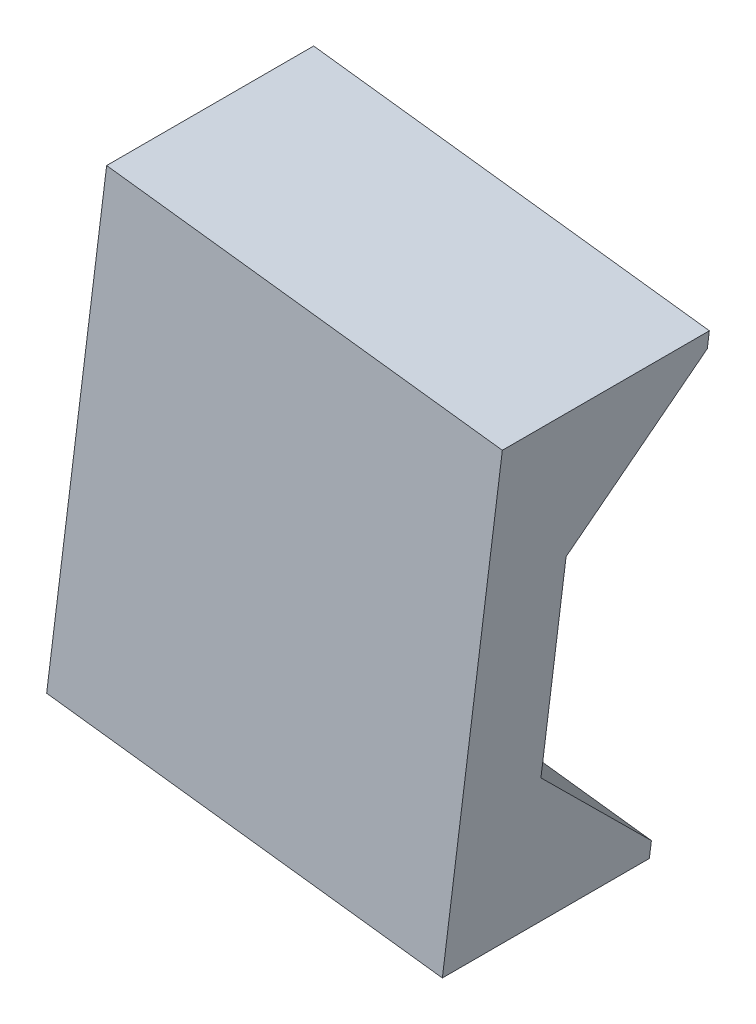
ISO-10303-21;
HEADER;
FILE_DESCRIPTION(('STEP AP214'),'2;1');
FILE_NAME('part.step','',(''),(''),'','','');
FILE_SCHEMA(('AUTOMOTIVE_DESIGN { 1 0 10303 214 1 1 1 1 }'));
ENDSEC;
DATA;
#1=APPLICATION_CONTEXT('core data for automotive mechanical design processes');
#2=APPLICATION_PROTOCOL_DEFINITION('international standard','automotive_design',2000,#1);
#3=PRODUCT_CONTEXT('',#1,'mechanical');
#4=PRODUCT('Part','Part','',(#3));
#5=PRODUCT_RELATED_PRODUCT_CATEGORY('part','',(#4));
#6=PRODUCT_DEFINITION_FORMATION('','',#4);
#7=PRODUCT_DEFINITION_CONTEXT('part definition',#1,'design');
#8=PRODUCT_DEFINITION('design','',#6,#7);
#9=PRODUCT_DEFINITION_SHAPE('','',#8);
#10=(LENGTH_UNIT() NAMED_UNIT(*) SI_UNIT(.MILLI.,.METRE.));
#11=(NAMED_UNIT(*) PLANE_ANGLE_UNIT() SI_UNIT($,.RADIAN.));
#12=(NAMED_UNIT(*) SI_UNIT($,.STERADIAN.) SOLID_ANGLE_UNIT());
#13=UNCERTAINTY_MEASURE_WITH_UNIT(LENGTH_MEASURE(1.E-05),#10,'distance_accuracy_value','');
#14=(GEOMETRIC_REPRESENTATION_CONTEXT(3) GLOBAL_UNCERTAINTY_ASSIGNED_CONTEXT((#13)) GLOBAL_UNIT_ASSIGNED_CONTEXT((#10,
#11,#12)) REPRESENTATION_CONTEXT('',''));
#15=CARTESIAN_POINT('',(0.,0.,0.));
#16=DIRECTION('',(0.,0.,1.));
#17=DIRECTION('',(1.,0.,0.));
#18=AXIS2_PLACEMENT_3D('',#15,#16,#17);
#19=CARTESIAN_POINT('',(65.66194823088,39.6217814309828,-21.43125));
#20=DIRECTION('',(0.,0.,-1.));
#21=DIRECTION('',(-1.,0.,0.));
#22=AXIS2_PLACEMENT_3D('',#19,#20,#21);
#23=PLANE('',#22);
#24=DIRECTION('',(-0.122264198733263,-0.99249758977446,0.));
#25=VECTOR('',#24,1.);
#26=CARTESIAN_POINT('',(-34.7543167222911,55.465332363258,-21.43125));
#27=LINE('',#26,#25);
#28=CARTESIAN_POINT('',(-34.7543167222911,55.465332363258,-21.43125));
#29=VERTEX_POINT('',#28);
#30=CARTESIAN_POINT('',(-35.1758068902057,52.0438240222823,-21.43125));
#31=VERTEX_POINT('',#30);
#32=EDGE_CURVE('E121',#29,#31,#27,.T.);
#33=ORIENTED_EDGE('',*,*,#32,.F.);
#34=DIRECTION('',(-0.99249758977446,0.122264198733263,0.));
#35=VECTOR('',#34,1.);
#36=CARTESIAN_POINT('',(66.0834383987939,43.0432897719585,-21.43125));
#37=LINE('',#36,#35);
#38=CARTESIAN_POINT('',(47.1763593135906,45.3724227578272,-21.43125));
#39=VERTEX_POINT('',#38);
#40=EDGE_CURVE('E86',#39,#29,#37,.T.);
#41=ORIENTED_EDGE('',*,*,#40,.F.);
#42=DIRECTION('',(-0.122264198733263,-0.99249758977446,0.));
#43=VECTOR('',#42,1.);
#44=CARTESIAN_POINT('',(47.1763593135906,45.3724227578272,-21.43125));
#45=LINE('',#44,#43);
#46=CARTESIAN_POINT('',(46.754869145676,41.9509144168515,-21.43125));
#47=VERTEX_POINT('',#46);
#48=EDGE_CURVE('E83',#39,#47,#45,.T.);
#49=ORIENTED_EDGE('',*,*,#48,.T.);
#50=DIRECTION('',(0.992497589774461,-0.122264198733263,0.));
#51=VECTOR('',#50,1.);
#52=CARTESIAN_POINT('',(-35.1758068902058,52.0438240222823,-21.43125));
#53=LINE('',#52,#51);
#54=EDGE_CURVE('E19',#31,#47,#53,.T.);
#55=ORIENTED_EDGE('',*,*,#54,.F.);
#56=EDGE_LOOP('',(#33,#41,#49,#55));
#57=FACE_BOUND('',#56,.T.);
#58=ADVANCED_FACE('F16',(#57),#23,.T.);
#59=CARTESIAN_POINT('',(62.4760410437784,13.759711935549,4.62631403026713));
#60=DIRECTION('',(-0.08645384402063,-0.701801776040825,-0.707106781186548));
#61=DIRECTION('',(0.,0.709764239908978,-0.704439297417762));
#62=AXIS2_PLACEMENT_3D('',#59,#60,#61);
#63=PLANE('',#62);
#64=DIRECTION('',(-0.0864538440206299,-0.701801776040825,0.707106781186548));
#65=VECTOR('',#64,1.);
#66=CARTESIAN_POINT('',(-35.1758068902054,52.0438240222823,-21.43125));
#67=LINE('',#66,#65);
#68=CARTESIAN_POINT('',(-38.3617140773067,26.1817545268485,4.62631403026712));
#69=VERTEX_POINT('',#68);
#70=EDGE_CURVE('E93',#31,#69,#67,.T.);
#71=ORIENTED_EDGE('',*,*,#70,.F.);
#72=ORIENTED_EDGE('',*,*,#54,.T.);
#73=DIRECTION('',(-0.0864538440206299,-0.701801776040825,0.707106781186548));
#74=VECTOR('',#73,1.);
#75=CARTESIAN_POINT('',(46.7548691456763,41.9509144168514,-21.43125));
#76=LINE('',#75,#74);
#77=CARTESIAN_POINT('',(43.568961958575,16.0888449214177,4.62631403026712));
#78=VERTEX_POINT('',#77);
#79=EDGE_CURVE('E78',#47,#78,#76,.T.);
#80=ORIENTED_EDGE('',*,*,#79,.T.);
#81=DIRECTION('',(0.992497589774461,-0.122264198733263,0.));
#82=VECTOR('',#81,1.);
#83=CARTESIAN_POINT('',(-38.3617140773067,26.1817545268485,4.62631403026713));
#84=LINE('',#83,#82);
#85=EDGE_CURVE('E95',#69,#78,#84,.T.);
#86=ORIENTED_EDGE('',*,*,#85,.F.);
#87=EDGE_LOOP('',(#71,#72,#80,#86));
#88=FACE_BOUND('',#87,.T.);
#89=ADVANCED_FACE('F91',(#88),#63,.T.);
#90=CARTESIAN_POINT('',(57.26879316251,-28.5108875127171,4.62631403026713));
#91=DIRECTION('',(0.,0.,-1.));
#92=DIRECTION('',(-1.,0.,0.));
#93=AXIS2_PLACEMENT_3D('',#90,#91,#92);
#94=PLANE('',#93);
#95=DIRECTION('',(-0.122264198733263,-0.99249758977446,0.));
#96=VECTOR('',#95,1.);
#97=CARTESIAN_POINT('',(-34.7543167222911,55.465332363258,4.62631403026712));
#98=LINE('',#97,#96);
#99=CARTESIAN_POINT('',(-43.568961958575,-16.0888449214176,4.62631403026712));
#100=VERTEX_POINT('',#99);
#101=EDGE_CURVE('E114',#69,#100,#98,.T.);
#102=ORIENTED_EDGE('',*,*,#101,.F.);
#103=ORIENTED_EDGE('',*,*,#85,.T.);
#104=DIRECTION('',(-0.122264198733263,-0.99249758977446,0.));
#105=VECTOR('',#104,1.);
#106=CARTESIAN_POINT('',(47.1763593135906,45.3724227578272,4.62631403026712));
#107=LINE('',#106,#105);
#108=CARTESIAN_POINT('',(38.3617140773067,-26.1817545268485,4.62631403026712));
#109=VERTEX_POINT('',#108);
#110=EDGE_CURVE('E100',#78,#109,#107,.T.);
#111=ORIENTED_EDGE('',*,*,#110,.T.);
#112=DIRECTION('',(0.992497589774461,-0.122264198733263,0.));
#113=VECTOR('',#112,1.);
#114=CARTESIAN_POINT('',(-43.568961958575,-16.0888449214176,4.62631403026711));
#115=LINE('',#114,#113);
#116=EDGE_CURVE('E108',#100,#109,#115,.T.);
#117=ORIENTED_EDGE('',*,*,#116,.F.);
#118=EDGE_LOOP('',(#102,#103,#111,#117));
#119=FACE_BOUND('',#118,.T.);
#120=ADVANCED_FACE('F112',(#119),#94,.T.);
#121=CARTESIAN_POINT('',(54.0828859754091,-54.372957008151,-21.43125));
#122=DIRECTION('',(0.0864538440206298,0.701801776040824,-0.707106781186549));
#123=DIRECTION('',(0.,0.709764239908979,0.704439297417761));
#124=AXIS2_PLACEMENT_3D('',#121,#122,#123);
#125=PLANE('',#124);
#126=DIRECTION('',(-0.0864538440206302,-0.701801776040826,-0.707106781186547));
#127=VECTOR('',#126,1.);
#128=CARTESIAN_POINT('',(-43.568961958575,-16.0888449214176,4.62631403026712));
#129=LINE('',#128,#127);
#130=CARTESIAN_POINT('',(-46.754869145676,-41.9509144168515,-21.43125));
#131=VERTEX_POINT('',#130);
#132=EDGE_CURVE('E117',#100,#131,#129,.T.);
#133=ORIENTED_EDGE('',*,*,#132,.F.);
#134=ORIENTED_EDGE('',*,*,#116,.T.);
#135=DIRECTION('',(-0.0864538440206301,-0.701801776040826,-0.707106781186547));
#136=VECTOR('',#135,1.);
#137=CARTESIAN_POINT('',(38.3617140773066,-26.1817545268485,4.62631403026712));
#138=LINE('',#137,#136);
#139=CARTESIAN_POINT('',(35.1758068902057,-52.0438240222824,-21.43125));
#140=VERTEX_POINT('',#139);
#141=EDGE_CURVE('E102',#109,#140,#138,.T.);
#142=ORIENTED_EDGE('',*,*,#141,.T.);
#143=DIRECTION('',(0.992497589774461,-0.122264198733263,0.));
#144=VECTOR('',#143,1.);
#145=CARTESIAN_POINT('',(-46.7548691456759,-41.9509144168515,-21.43125));
#146=LINE('',#145,#144);
#147=EDGE_CURVE('E89',#131,#140,#146,.T.);
#148=ORIENTED_EDGE('',*,*,#147,.F.);
#149=EDGE_LOOP('',(#133,#134,#142,#148));
#150=FACE_BOUND('',#149,.T.);
#151=ADVANCED_FACE('F133',(#150),#125,.T.);
#152=CARTESIAN_POINT('',(53.6613958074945,-57.7944653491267,-21.43125));
#153=DIRECTION('',(0.,0.,-1.));
#154=DIRECTION('',(-1.,0.,0.));
#155=AXIS2_PLACEMENT_3D('',#152,#153,#154);
#156=PLANE('',#155);
#157=DIRECTION('',(-0.122264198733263,-0.99249758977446,0.));
#158=VECTOR('',#157,1.);
#159=CARTESIAN_POINT('',(-34.7543167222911,55.465332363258,-21.43125));
#160=LINE('',#159,#158);
#161=CARTESIAN_POINT('',(-47.1763593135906,-45.3724227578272,-21.43125));
#162=VERTEX_POINT('',#161);
#163=EDGE_CURVE('E139',#131,#162,#160,.T.);
#164=ORIENTED_EDGE('',*,*,#163,.F.);
#165=ORIENTED_EDGE('',*,*,#147,.T.);
#166=DIRECTION('',(-0.122264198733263,-0.99249758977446,0.));
#167=VECTOR('',#166,1.);
#168=CARTESIAN_POINT('',(47.1763593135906,45.3724227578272,-21.43125));
#169=LINE('',#168,#167);
#170=CARTESIAN_POINT('',(34.7543167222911,-55.465332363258,-21.43125));
#171=VERTEX_POINT('',#170);
#172=EDGE_CURVE('E131',#140,#171,#169,.T.);
#173=ORIENTED_EDGE('',*,*,#172,.T.);
#174=DIRECTION('',(0.99249758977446,-0.122264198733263,0.));
#175=VECTOR('',#174,1.);
#176=CARTESIAN_POINT('',(53.6613958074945,-57.7944653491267,-21.43125));
#177=LINE('',#176,#175);
#178=EDGE_CURVE('E147',#162,#171,#177,.T.);
#179=ORIENTED_EDGE('',*,*,#178,.F.);
#180=EDGE_LOOP('',(#164,#165,#173,#179));
#181=FACE_BOUND('',#180,.T.);
#182=ADVANCED_FACE('F137',(#181),#156,.T.);
#183=CARTESIAN_POINT('',(47.1763593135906,45.3724227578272,21.43125));
#184=DIRECTION('',(-0.99249758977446,0.122264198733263,0.));
#185=DIRECTION('',(-0.122264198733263,-0.99249758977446,0.));
#186=AXIS2_PLACEMENT_3D('',#183,#184,#185);
#187=PLANE('',#186);
#188=DIRECTION('',(0.,0.,1.));
#189=VECTOR('',#188,1.);
#190=CARTESIAN_POINT('',(34.7543167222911,-55.465332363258,21.43125));
#191=LINE('',#190,#189);
#192=CARTESIAN_POINT('',(34.7543167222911,-55.465332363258,21.43125));
#193=VERTEX_POINT('',#192);
#194=EDGE_CURVE('E141',#171,#193,#191,.T.);
#195=ORIENTED_EDGE('',*,*,#194,.F.);
#196=ORIENTED_EDGE('',*,*,#172,.F.);
#197=ORIENTED_EDGE('',*,*,#141,.F.);
#198=ORIENTED_EDGE('',*,*,#110,.F.);
#199=ORIENTED_EDGE('',*,*,#79,.F.);
#200=ORIENTED_EDGE('',*,*,#48,.F.);
#201=DIRECTION('',(0.,0.,1.));
#202=VECTOR('',#201,1.);
#203=CARTESIAN_POINT('',(47.1763593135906,45.3724227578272,-21.43125));
#204=LINE('',#203,#202);
#205=CARTESIAN_POINT('',(47.1763593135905,45.3724227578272,21.43125));
#206=VERTEX_POINT('',#205);
#207=EDGE_CURVE('E129',#206,#39,#204,.F.);
#208=ORIENTED_EDGE('',*,*,#207,.F.);
#209=DIRECTION('',(0.122264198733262,0.99249758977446,0.));
#210=VECTOR('',#209,1.);
#211=CARTESIAN_POINT('',(34.7543167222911,-55.465332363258,21.43125));
#212=LINE('',#211,#210);
#213=EDGE_CURVE('E144',#193,#206,#212,.T.);
#214=ORIENTED_EDGE('',*,*,#213,.F.);
#215=EDGE_LOOP('',(#195,#196,#197,#198,#199,#200,#208,#214));
#216=FACE_BOUND('',#215,.T.);
#217=ADVANCED_FACE('F98',(#216),#187,.F.);
#218=CARTESIAN_POINT('',(66.0834383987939,43.0432897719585,-21.43125));
#219=DIRECTION('',(0.122264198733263,0.99249758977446,0.));
#220=DIRECTION('',(-0.99249758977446,0.122264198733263,0.));
#221=AXIS2_PLACEMENT_3D('',#218,#219,#220);
#222=PLANE('',#221);
#223=DIRECTION('',(0.,0.,1.));
#224=VECTOR('',#223,1.);
#225=CARTESIAN_POINT('',(-34.7543167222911,55.465332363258,21.43125));
#226=LINE('',#225,#224);
#227=CARTESIAN_POINT('',(-34.7543167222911,55.465332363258,21.43125));
#228=VERTEX_POINT('',#227);
#229=EDGE_CURVE('E123',#228,#29,#226,.F.);
#230=ORIENTED_EDGE('',*,*,#229,.F.);
#231=DIRECTION('',(-0.992497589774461,0.122264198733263,0.));
#232=VECTOR('',#231,1.);
#233=CARTESIAN_POINT('',(47.1763593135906,45.3724227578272,21.43125));
#234=LINE('',#233,#232);
#235=EDGE_CURVE('E150',#206,#228,#234,.T.);
#236=ORIENTED_EDGE('',*,*,#235,.F.);
#237=ORIENTED_EDGE('',*,*,#207,.T.);
#238=ORIENTED_EDGE('',*,*,#40,.T.);
#239=EDGE_LOOP('',(#230,#236,#237,#238));
#240=FACE_BOUND('',#239,.T.);
#241=ADVANCED_FACE('F162',(#240),#222,.T.);
#242=CARTESIAN_POINT('',(-34.7543167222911,55.465332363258,21.43125));
#243=DIRECTION('',(-0.99249758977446,0.122264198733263,0.));
#244=DIRECTION('',(-0.122264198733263,-0.99249758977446,0.));
#245=AXIS2_PLACEMENT_3D('',#242,#243,#244);
#246=PLANE('',#245);
#247=ORIENTED_EDGE('',*,*,#163,.T.);
#248=DIRECTION('',(0.,0.,1.));
#249=VECTOR('',#248,1.);
#250=CARTESIAN_POINT('',(-47.1763593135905,-45.3724227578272,21.43125));
#251=LINE('',#250,#249);
#252=CARTESIAN_POINT('',(-47.1763593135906,-45.3724227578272,21.43125));
#253=VERTEX_POINT('',#252);
#254=EDGE_CURVE('E34',#253,#162,#251,.F.);
#255=ORIENTED_EDGE('',*,*,#254,.F.);
#256=DIRECTION('',(-0.122264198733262,-0.992497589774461,0.));
#257=VECTOR('',#256,1.);
#258=CARTESIAN_POINT('',(-34.7543167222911,55.465332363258,21.43125));
#259=LINE('',#258,#257);
#260=EDGE_CURVE('E25',#228,#253,#259,.T.);
#261=ORIENTED_EDGE('',*,*,#260,.F.);
#262=ORIENTED_EDGE('',*,*,#229,.T.);
#263=ORIENTED_EDGE('',*,*,#32,.T.);
#264=ORIENTED_EDGE('',*,*,#70,.T.);
#265=ORIENTED_EDGE('',*,*,#101,.T.);
#266=ORIENTED_EDGE('',*,*,#132,.T.);
#267=EDGE_LOOP('',(#247,#255,#261,#262,#263,#264,#265,#266));
#268=FACE_BOUND('',#267,.T.);
#269=ADVANCED_FACE('F119',(#268),#246,.T.);
#270=CARTESIAN_POINT('',(53.6613958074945,-57.7944653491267,21.43125));
#271=DIRECTION('',(-0.122264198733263,-0.99249758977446,0.));
#272=DIRECTION('',(0.99249758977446,-0.122264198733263,0.));
#273=AXIS2_PLACEMENT_3D('',#270,#271,#272);
#274=PLANE('',#273);
#275=ORIENTED_EDGE('',*,*,#254,.T.);
#276=ORIENTED_EDGE('',*,*,#178,.T.);
#277=ORIENTED_EDGE('',*,*,#194,.T.);
#278=DIRECTION('',(0.992497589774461,-0.122264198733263,0.));
#279=VECTOR('',#278,1.);
#280=CARTESIAN_POINT('',(-47.1763593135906,-45.3724227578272,21.43125));
#281=LINE('',#280,#279);
#282=EDGE_CURVE('E11',#253,#193,#281,.T.);
#283=ORIENTED_EDGE('',*,*,#282,.F.);
#284=EDGE_LOOP('',(#275,#276,#277,#283));
#285=FACE_BOUND('',#284,.T.);
#286=ADVANCED_FACE('F148',(#285),#274,.T.);
#287=CARTESIAN_POINT('',(66.0834383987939,43.0432897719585,21.43125));
#288=DIRECTION('',(0.,0.,1.));
#289=DIRECTION('',(1.,0.,0.));
#290=AXIS2_PLACEMENT_3D('',#287,#288,#289);
#291=PLANE('',#290);
#292=ORIENTED_EDGE('',*,*,#260,.T.);
#293=ORIENTED_EDGE('',*,*,#282,.T.);
#294=ORIENTED_EDGE('',*,*,#213,.T.);
#295=ORIENTED_EDGE('',*,*,#235,.T.);
#296=EDGE_LOOP('',(#292,#293,#294,#295));
#297=FACE_BOUND('',#296,.T.);
#298=ADVANCED_FACE('F159',(#297),#291,.T.);
#299=CLOSED_SHELL('',(#58,#89,#120,#151,#182,#217,#241,#269,#286,#298));
#300=MANIFOLD_SOLID_BREP('B1',#299);
#301=ADVANCED_BREP_SHAPE_REPRESENTATION('',(#18,#300),#14);
#302=SHAPE_DEFINITION_REPRESENTATION(#9,#301);
ENDSEC;
END-ISO-10303-21;
